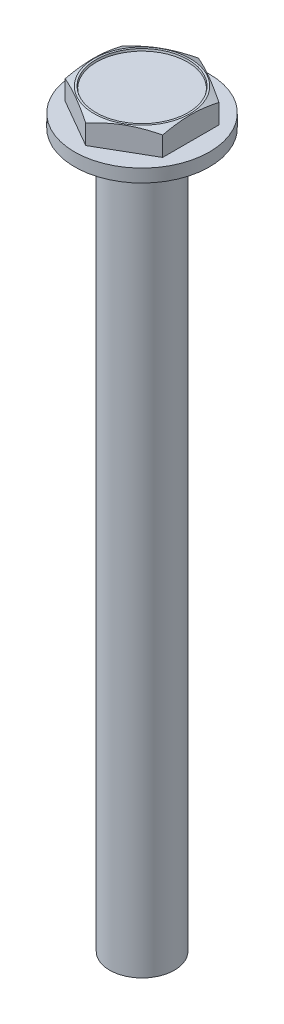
ISO-10303-21;
HEADER;
FILE_DESCRIPTION(('STEP AP214'),'2;1');
FILE_NAME('part.step','',(''),(''),'','','');
FILE_SCHEMA(('AUTOMOTIVE_DESIGN { 1 0 10303 214 1 1 1 1 }'));
ENDSEC;
DATA;
#1=APPLICATION_CONTEXT('core data for automotive mechanical design processes');
#2=APPLICATION_PROTOCOL_DEFINITION('international standard','automotive_design',2000,#1);
#3=PRODUCT_CONTEXT('',#1,'mechanical');
#4=PRODUCT('Part','Part','',(#3));
#5=PRODUCT_RELATED_PRODUCT_CATEGORY('part','',(#4));
#6=PRODUCT_DEFINITION_FORMATION('','',#4);
#7=PRODUCT_DEFINITION_CONTEXT('part definition',#1,'design');
#8=PRODUCT_DEFINITION('design','',#6,#7);
#9=PRODUCT_DEFINITION_SHAPE('','',#8);
#10=(LENGTH_UNIT() NAMED_UNIT(*) SI_UNIT(.MILLI.,.METRE.));
#11=(NAMED_UNIT(*) PLANE_ANGLE_UNIT() SI_UNIT($,.RADIAN.));
#12=(NAMED_UNIT(*) SI_UNIT($,.STERADIAN.) SOLID_ANGLE_UNIT());
#13=UNCERTAINTY_MEASURE_WITH_UNIT(LENGTH_MEASURE(1.E-05),#10,'distance_accuracy_value','');
#14=(GEOMETRIC_REPRESENTATION_CONTEXT(3) GLOBAL_UNCERTAINTY_ASSIGNED_CONTEXT((#13)) GLOBAL_UNIT_ASSIGNED_CONTEXT((#10,
#11,#12)) REPRESENTATION_CONTEXT('',''));
#15=CARTESIAN_POINT('',(0.,0.,0.));
#16=DIRECTION('',(0.,0.,1.));
#17=DIRECTION('',(1.,0.,0.));
#18=AXIS2_PLACEMENT_3D('',#15,#16,#17);
#19=CARTESIAN_POINT('',(0.,0.,0.));
#20=DIRECTION('',(0.,-1.,0.));
#21=DIRECTION('',(0.,0.,-1.));
#22=AXIS2_PLACEMENT_3D('',#19,#20,#21);
#23=CYLINDRICAL_SURFACE('',#22,3.30199714);
#24=CARTESIAN_POINT('',(0.,0.,0.));
#25=DIRECTION('',(0.,-1.,0.));
#26=DIRECTION('',(0.,0.,-1.));
#27=AXIS2_PLACEMENT_3D('',#24,#25,#26);
#28=CIRCLE('',#27,3.30199714);
#29=CARTESIAN_POINT('',(0.,0.,-3.30199714));
#30=VERTEX_POINT('',#29);
#31=EDGE_CURVE('E133',#30,#30,#28,.T.);
#32=ORIENTED_EDGE('',*,*,#31,.F.);
#33=EDGE_LOOP('',(#32));
#34=FACE_BOUND('',#33,.T.);
#35=CARTESIAN_POINT('',(0.,0.63499945,0.));
#36=DIRECTION('',(0.,1.,0.));
#37=DIRECTION('',(0.,0.,1.));
#38=AXIS2_PLACEMENT_3D('',#35,#36,#37);
#39=CIRCLE('',#38,3.30199714);
#40=CARTESIAN_POINT('',(0.,0.63499945,3.30199714));
#41=VERTEX_POINT('',#40);
#42=EDGE_CURVE('E32',#41,#41,#39,.F.);
#43=ORIENTED_EDGE('',*,*,#42,.T.);
#44=EDGE_LOOP('',(#43));
#45=FACE_BOUND('',#44,.T.);
#46=ADVANCED_FACE('F28',(#34,#45),#23,.T.);
#47=CARTESIAN_POINT('',(0.,0.,0.));
#48=DIRECTION('',(0.,-1.,0.));
#49=DIRECTION('',(0.,0.,-1.));
#50=AXIS2_PLACEMENT_3D('',#47,#48,#49);
#51=PLANE('',#50);
#52=CARTESIAN_POINT('',(0.,0.,0.));
#53=DIRECTION('',(0.,-1.,0.));
#54=DIRECTION('',(0.,0.,-1.));
#55=AXIS2_PLACEMENT_3D('',#52,#53,#54);
#56=CIRCLE('',#55,1.587498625);
#57=CARTESIAN_POINT('',(0.,0.,-1.587498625));
#58=VERTEX_POINT('',#57);
#59=EDGE_CURVE('E136',#58,#58,#56,.T.);
#60=ORIENTED_EDGE('',*,*,#59,.F.);
#61=EDGE_LOOP('',(#60));
#62=FACE_BOUND('',#61,.T.);
#63=ORIENTED_EDGE('',*,*,#31,.T.);
#64=EDGE_LOOP('',(#63));
#65=FACE_BOUND('',#64,.T.);
#66=ADVANCED_FACE('F30',(#62,#65),#51,.T.);
#67=CARTESIAN_POINT('',(0.,-34.925,0.));
#68=DIRECTION('',(0.,-1.,0.));
#69=DIRECTION('',(0.,0.,-1.));
#70=AXIS2_PLACEMENT_3D('',#67,#68,#69);
#71=PLANE('',#70);
#72=CARTESIAN_POINT('',(0.,-34.925,0.));
#73=DIRECTION('',(0.,-1.,0.));
#74=DIRECTION('',(0.,0.,-1.));
#75=AXIS2_PLACEMENT_3D('',#72,#73,#74);
#76=CIRCLE('',#75,1.587498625);
#77=CARTESIAN_POINT('',(0.,-34.925,-1.587498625));
#78=VERTEX_POINT('',#77);
#79=EDGE_CURVE('E121',#78,#78,#76,.T.);
#80=ORIENTED_EDGE('',*,*,#79,.T.);
#81=EDGE_LOOP('',(#80));
#82=FACE_BOUND('',#81,.T.);
#83=ADVANCED_FACE('F212',(#82),#71,.T.);
#84=CARTESIAN_POINT('',(0.,0.,0.));
#85=DIRECTION('',(0.,-1.,0.));
#86=DIRECTION('',(0.,0.,-1.));
#87=AXIS2_PLACEMENT_3D('',#84,#85,#86);
#88=CYLINDRICAL_SURFACE('',#87,1.587498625);
#89=ORIENTED_EDGE('',*,*,#59,.T.);
#90=EDGE_LOOP('',(#89));
#91=FACE_BOUND('',#90,.T.);
#92=ORIENTED_EDGE('',*,*,#79,.F.);
#93=EDGE_LOOP('',(#92));
#94=FACE_BOUND('',#93,.T.);
#95=ADVANCED_FACE('F219',(#91,#94),#88,.T.);
#96=CARTESIAN_POINT('',(-3.632196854,0.63499945,3.632196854));
#97=DIRECTION('',(0.,1.,0.));
#98=DIRECTION('',(0.,0.,1.));
#99=AXIS2_PLACEMENT_3D('',#96,#97,#98);
#100=PLANE('',#99);
#101=ORIENTED_EDGE('',*,*,#42,.F.);
#102=EDGE_LOOP('',(#101));
#103=FACE_BOUND('',#102,.T.);
#104=DIRECTION('',(-0.866025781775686,0.,0.499999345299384));
#105=VECTOR('',#104,1.);
#106=CARTESIAN_POINT('',(1.87579371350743E-06,0.63499945,-2.75696049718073));
#107=LINE('',#106,#105);
#108=CARTESIAN_POINT('',(1.87579371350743E-06,0.63499945,-2.75696049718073));
#109=VERTEX_POINT('',#108);
#110=CARTESIAN_POINT('',(-2.38759668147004,0.63499945,-1.37848223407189));
#111=VERTEX_POINT('',#110);
#112=EDGE_CURVE('E86',#109,#111,#107,.T.);
#113=ORIENTED_EDGE('',*,*,#112,.F.);
#114=DIRECTION('',(-0.866025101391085,0.,-0.500000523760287));
#115=VECTOR('',#114,1.);
#116=CARTESIAN_POINT('',(2.38759855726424,0.63499945,-1.37847898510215));
#117=LINE('',#116,#115);
#118=CARTESIAN_POINT('',(2.38759855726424,0.63499945,-1.37847898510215));
#119=VERTEX_POINT('',#118);
#120=EDGE_CURVE('E106',#119,#109,#117,.T.);
#121=ORIENTED_EDGE('',*,*,#120,.F.);
#122=DIRECTION('',(4.53589793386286E-07,0.,-0.999999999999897));
#123=VECTOR('',#122,1.);
#124=CARTESIAN_POINT('',(2.38759730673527,0.63499945,1.37848115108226));
#125=LINE('',#124,#123);
#126=CARTESIAN_POINT('',(2.38759730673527,0.63499945,1.37848115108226));
#127=VERTEX_POINT('',#126);
#128=EDGE_CURVE('E103',#127,#119,#125,.T.);
#129=ORIENTED_EDGE('',*,*,#128,.F.);
#130=DIRECTION('',(0.866025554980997,0.,-0.499999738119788));
#131=VECTOR('',#130,1.);
#132=CARTESIAN_POINT('',(-6.25264571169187E-07,0.63499945,2.7569604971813));
#133=LINE('',#132,#131);
#134=CARTESIAN_POINT('',(-6.25264571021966E-07,0.63499945,2.7569604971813));
#135=VERTEX_POINT('',#134);
#136=EDGE_CURVE('E96',#135,#127,#133,.T.);
#137=ORIENTED_EDGE('',*,*,#136,.F.);
#138=DIRECTION('',(0.86602532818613,0.,0.500000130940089));
#139=VECTOR('',#138,1.);
#140=CARTESIAN_POINT('',(-2.387597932,0.63499945,1.37848006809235));
#141=LINE('',#140,#139);
#142=CARTESIAN_POINT('',(-2.387597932,0.63499945,1.37848006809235));
#143=VERTEX_POINT('',#142);
#144=EDGE_CURVE('E82',#143,#135,#141,.T.);
#145=ORIENTED_EDGE('',*,*,#144,.F.);
#146=DIRECTION('',(-4.53589793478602E-07,0.,0.999999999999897));
#147=VECTOR('',#146,1.);
#148=CARTESIAN_POINT('',(-2.38759668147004,0.63499945,-1.37848223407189));
#149=LINE('',#148,#147);
#150=EDGE_CURVE('E92',#111,#143,#149,.T.);
#151=ORIENTED_EDGE('',*,*,#150,.F.);
#152=EDGE_LOOP('',(#113,#121,#129,#137,#145,#151));
#153=FACE_BOUND('',#152,.T.);
#154=ADVANCED_FACE('F91',(#103,#153),#100,.T.);
#155=CARTESIAN_POINT('',(-2.38759668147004,0.63499945,-1.37848223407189));
#156=DIRECTION('',(-0.999999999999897,0.,-4.53589793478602E-07));
#157=DIRECTION('',(-4.53589793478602E-07,0.,0.999999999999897));
#158=AXIS2_PLACEMENT_3D('',#155,#156,#157);
#159=PLANE('',#158);
#160=DIRECTION('',(0.,1.,0.));
#161=VECTOR('',#160,1.);
#162=CARTESIAN_POINT('',(-2.38759668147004,0.63499945,-1.37848223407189));
#163=LINE('',#162,#161);
#164=CARTESIAN_POINT('',(-2.38759668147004,1.58662449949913,-1.37848223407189));
#165=VERTEX_POINT('',#164);
#166=EDGE_CURVE('E99',#111,#165,#163,.T.);
#167=ORIENTED_EDGE('',*,*,#166,.F.);
#168=ORIENTED_EDGE('',*,*,#150,.T.);
#169=DIRECTION('',(0.,1.,0.));
#170=VECTOR('',#169,1.);
#171=CARTESIAN_POINT('',(-2.387597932,0.63499945,1.37848006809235));
#172=LINE('',#171,#170);
#173=CARTESIAN_POINT('',(-2.387597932,1.58662449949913,1.37848006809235));
#174=VERTEX_POINT('',#173);
#175=EDGE_CURVE('E79',#143,#174,#172,.T.);
#176=ORIENTED_EDGE('',*,*,#175,.T.);
#177=CARTESIAN_POINT('',(-2.38759563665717,0.82592264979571,-3.68191339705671));
#178=CARTESIAN_POINT('',(-2.38759568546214,0.868007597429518,-3.5743162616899));
#179=CARTESIAN_POINT('',(-2.38759573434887,0.909640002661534,-3.46653884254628));
#180=CARTESIAN_POINT('',(-2.3875958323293,0.991743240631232,-3.25052774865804));
#181=CARTESIAN_POINT('',(-2.38759588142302,1.03221392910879,-3.14229401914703));
#182=CARTESIAN_POINT('',(-2.38759598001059,1.11185744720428,-2.92494439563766));
#183=CARTESIAN_POINT('',(-2.38759602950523,1.15102557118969,-2.81582677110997));
#184=CARTESIAN_POINT('',(-2.38759612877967,1.22755881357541,-2.59696285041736));
#185=CARTESIAN_POINT('',(-2.38759617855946,1.26492399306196,-2.48721657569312));
#186=CARTESIAN_POINT('',(-2.3875962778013,1.33690696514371,-2.26842452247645));
#187=CARTESIAN_POINT('',(-2.38759632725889,1.37155447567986,-2.15938857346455));
#188=CARTESIAN_POINT('',(-2.38759642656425,1.43805781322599,-1.94045649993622));
#189=CARTESIAN_POINT('',(-2.38759647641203,1.4699134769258,-1.83056032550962));
#190=CARTESIAN_POINT('',(-2.38759657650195,1.53006082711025,-1.60989856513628));
#191=CARTESIAN_POINT('',(-2.38759662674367,1.55835590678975,-1.49913391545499));
#192=CARTESIAN_POINT('',(-2.38759672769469,1.6105119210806,-1.27657374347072));
#193=CARTESIAN_POINT('',(-2.38759677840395,1.63437327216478,-1.16477831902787));
#194=CARTESIAN_POINT('',(-2.38759689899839,1.68436690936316,-0.898911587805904));
#195=CARTESIAN_POINT('',(-2.38759696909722,1.70812390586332,-0.744369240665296));
#196=CARTESIAN_POINT('',(-2.38759707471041,1.73414034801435,-0.511530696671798));
#197=CARTESIAN_POINT('',(-2.38759710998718,1.74120899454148,-0.433758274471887));
#198=CARTESIAN_POINT('',(-2.38759718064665,1.7519158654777,-0.277979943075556));
#199=CARTESIAN_POINT('',(-2.38759721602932,1.75555444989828,-0.199974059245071));
#200=CARTESIAN_POINT('',(-2.3875972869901,1.75927506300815,-0.043531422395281));
#201=CARTESIAN_POINT('',(-2.38759732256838,1.75934126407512,0.0349057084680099));
#202=CARTESIAN_POINT('',(-2.3875973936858,1.75587572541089,0.191693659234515));
#203=CARTESIAN_POINT('',(-2.38759742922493,1.75234425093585,0.270044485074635));
#204=CARTESIAN_POINT('',(-2.38759750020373,1.74181206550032,0.426526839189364));
#205=CARTESIAN_POINT('',(-2.38759753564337,1.73481064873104,0.504658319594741));
#206=CARTESIAN_POINT('',(-2.38759760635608,1.71757822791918,0.660554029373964));
#207=CARTESIAN_POINT('',(-2.38759764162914,1.70734734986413,0.738318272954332));
#208=CARTESIAN_POINT('',(-2.38759777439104,1.6632145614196,1.03100981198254));
#209=CARTESIAN_POINT('',(-2.38759787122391,1.61952154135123,1.24449097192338));
#210=CARTESIAN_POINT('',(-2.38759801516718,1.54248199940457,1.56183336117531));
#211=CARTESIAN_POINT('',(-2.38759806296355,1.51486214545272,1.66720691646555));
#212=CARTESIAN_POINT('',(-2.38759815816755,1.45652585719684,1.87709700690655));
#213=CARTESIAN_POINT('',(-2.38759820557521,1.42580963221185,1.98161359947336));
#214=CARTESIAN_POINT('',(-2.38759834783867,1.32960807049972,2.29525260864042));
#215=CARTESIAN_POINT('',(-2.38759844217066,1.26038803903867,2.50322024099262));
#216=CARTESIAN_POINT('',(-2.38759862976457,1.11566696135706,2.91679636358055));
#217=CARTESIAN_POINT('',(-2.387598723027,1.04016911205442,3.12240599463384));
#218=CARTESIAN_POINT('',(-2.38759890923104,0.884641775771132,3.53291795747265));
#219=CARTESIAN_POINT('',(-2.38759900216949,0.804594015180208,3.73781332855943));
#220=CARTESIAN_POINT('',(-2.38759918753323,0.641592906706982,4.14647276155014));
#221=CARTESIAN_POINT('',(-2.38759927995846,0.558639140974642,4.35023665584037));
#222=CARTESIAN_POINT('',(-2.3875994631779,0.391826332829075,4.75416868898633));
#223=CARTESIAN_POINT('',(-2.38759955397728,0.307994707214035,4.95434818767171));
#224=CARTESIAN_POINT('',(-2.38759973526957,0.138862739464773,5.35403153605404));
#225=CARTESIAN_POINT('',(-2.38759982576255,0.053562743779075,5.55353553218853));
#226=CARTESIAN_POINT('',(-2.38759991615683,-0.0322324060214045,5.75282195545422));
#227=B_SPLINE_CURVE_WITH_KNOTS('',3,(#177,#178,#179,#180,#181,#182,#183,#184,#185,#186,#187,
#188,#189,#190,#191,#192,#193,#194,#195,#196,#197,#198,#199,#200,#201,#202,#203,#204,#205,#206,
#207,#208,#209,#210,#211,#212,#213,#214,#215,#216,#217,#218,#219,#220,#221,#222,#223,#224,#225,
#226),.UNSPECIFIED.,.F.,.F.,(4,2,2,2,2,2,2,2,2,2,2,2,2,2,2,2,2,2,2,2,2,2,2,2,4),(0.,
0.346607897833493,0.693258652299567,1.04104935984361,1.38882827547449,1.73202382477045,
2.07523943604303,2.4181254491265,2.76097923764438,3.22954472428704,3.46376008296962,
3.69795085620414,3.93317913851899,4.16839007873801,4.40364888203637,4.63889850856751,
5.29155455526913,5.61833976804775,5.94510290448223,6.60247648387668,7.25951732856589,
7.91941453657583,8.57940702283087,9.23047341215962,9.88138823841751),.UNSPECIFIED.);
#228=EDGE_CURVE('E11',#165,#174,#227,.T.);
#229=ORIENTED_EDGE('',*,*,#228,.F.);
#230=EDGE_LOOP('',(#167,#168,#176,#229));
#231=FACE_BOUND('',#230,.T.);
#232=ADVANCED_FACE('F98',(#231),#159,.T.);
#233=CARTESIAN_POINT('',(1.87579371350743E-06,0.63499945,-2.75696049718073));
#234=DIRECTION('',(-0.499999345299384,0.,-0.866025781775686));
#235=DIRECTION('',(-0.866025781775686,0.,0.499999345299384));
#236=AXIS2_PLACEMENT_3D('',#233,#234,#235);
#237=PLANE('',#236);
#238=DIRECTION('',(0.,1.,0.));
#239=VECTOR('',#238,1.);
#240=CARTESIAN_POINT('',(1.87579371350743E-06,0.63499945,-2.75696049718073));
#241=LINE('',#240,#239);
#242=CARTESIAN_POINT('',(1.87579371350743E-06,1.58662449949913,-2.75696049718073));
#243=VERTEX_POINT('',#242);
#244=EDGE_CURVE('E111',#109,#243,#241,.T.);
#245=ORIENTED_EDGE('',*,*,#244,.F.);
#246=ORIENTED_EDGE('',*,*,#112,.T.);
#247=ORIENTED_EDGE('',*,*,#166,.T.);
#248=CARTESIAN_POINT('',(0.00020187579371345,1.58657065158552,-2.75707596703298));
#249=CARTESIAN_POINT('',(-0.072006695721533,1.60601236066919,-2.71538640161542));
#250=CARTESIAN_POINT('',(-0.144481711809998,1.62420572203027,-2.67354300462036));
#251=CARTESIAN_POINT('',(-0.289975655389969,1.65766237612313,-2.58954218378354));
#252=CARTESIAN_POINT('',(-0.362994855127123,1.67292408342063,-2.54738460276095));
#253=CARTESIAN_POINT('',(-0.509578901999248,1.70007484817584,-2.46275441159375));
#254=CARTESIAN_POINT('',(-0.583144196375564,1.71196073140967,-2.42028154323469));
#255=CARTESIAN_POINT('',(-0.730652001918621,1.73192108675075,-2.33511802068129));
#256=CARTESIAN_POINT('',(-0.804594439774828,1.73999627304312,-2.29242740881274));
#257=CARTESIAN_POINT('',(-0.951197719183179,1.75188911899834,-2.20778611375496));
#258=CARTESIAN_POINT('',(-1.02385333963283,1.75579159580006,-2.1658384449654));
#259=CARTESIAN_POINT('',(-1.16924844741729,1.7594692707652,-2.0818946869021));
#260=CARTESIAN_POINT('',(-1.24198793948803,1.75924422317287,-2.03989859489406));
#261=CARTESIAN_POINT('',(-1.38729615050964,1.75467833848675,-1.95600500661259));
#262=CARTESIAN_POINT('',(-1.45986496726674,1.75034158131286,-1.91410745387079));
#263=CARTESIAN_POINT('',(-1.60474605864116,1.73773860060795,-1.83046046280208));
#264=CARTESIAN_POINT('',(-1.67705832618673,1.72947226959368,-1.78871102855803));
#265=CARTESIAN_POINT('',(-1.80267576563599,1.7119279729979,-1.71618589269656));
#266=CARTESIAN_POINT('',(-1.85606796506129,1.70346223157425,-1.68535994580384));
#267=CARTESIAN_POINT('',(-1.96260822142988,1.68470190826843,-1.62384900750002));
#268=CARTESIAN_POINT('',(-2.01575628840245,1.67440740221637,-1.59316401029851));
#269=CARTESIAN_POINT('',(-2.12221905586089,1.65206814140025,-1.53169781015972));
#270=CARTESIAN_POINT('',(-2.17553161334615,1.6400098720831,-1.50091784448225));
#271=CARTESIAN_POINT('',(-2.28187473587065,1.61438127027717,-1.43952072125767));
#272=CARTESIAN_POINT('',(-2.3349053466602,1.60081119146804,-1.40890353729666));
#273=CARTESIAN_POINT('',(-2.38779668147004,1.58657065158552,-1.37836676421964));
#274=B_SPLINE_CURVE_WITH_KNOTS('',3,(#248,#249,#250,#251,#252,#253,#254,#255,#256,#257,#258,
#259,#260,#261,#262,#263,#264,#265,#266,#267,#268,#269,#270,#271,#272,#273),.UNSPECIFIED.,.F.,
.F.,(4,2,2,2,2,2,2,2,2,2,2,2,4),(0.,0.256862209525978,0.51386294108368,0.771104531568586,
1.02829789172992,1.28015774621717,1.53203259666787,1.78365778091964,2.03528984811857,
2.22195401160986,2.40861043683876,2.59678030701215,2.78491864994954),.UNSPECIFIED.);
#275=EDGE_CURVE('E37',#243,#165,#274,.T.);
#276=ORIENTED_EDGE('',*,*,#275,.F.);
#277=EDGE_LOOP('',(#245,#246,#247,#276));
#278=FACE_BOUND('',#277,.T.);
#279=ADVANCED_FACE('F164',(#278),#237,.T.);
#280=CARTESIAN_POINT('',(2.38759855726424,0.63499945,-1.37847898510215));
#281=DIRECTION('',(0.500000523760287,0.,-0.866025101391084));
#282=DIRECTION('',(-0.866025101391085,0.,-0.500000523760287));
#283=AXIS2_PLACEMENT_3D('',#280,#281,#282);
#284=PLANE('',#283);
#285=DIRECTION('',(0.,1.,0.));
#286=VECTOR('',#285,1.);
#287=CARTESIAN_POINT('',(2.38759855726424,0.63499945,-1.37847898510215));
#288=LINE('',#287,#286);
#289=CARTESIAN_POINT('',(2.38759855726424,1.58662449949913,-1.37847898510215));
#290=VERTEX_POINT('',#289);
#291=EDGE_CURVE('E114',#119,#290,#288,.T.);
#292=ORIENTED_EDGE('',*,*,#291,.F.);
#293=ORIENTED_EDGE('',*,*,#120,.T.);
#294=ORIENTED_EDGE('',*,*,#244,.T.);
#295=CARTESIAN_POINT('',(2.38779855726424,1.58657065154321,-1.37836351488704));
#296=CARTESIAN_POINT('',(2.31559004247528,1.60601236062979,-1.42005317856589));
#297=CARTESIAN_POINT('',(2.24311508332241,1.62420572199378,-1.46189667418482));
#298=CARTESIAN_POINT('',(2.09762125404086,1.65766237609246,-1.54589769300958));
#299=CARTESIAN_POINT('',(2.02460211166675,1.67292408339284,-1.58805537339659));
#300=CARTESIAN_POINT('',(1.87801817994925,1.70007484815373,-1.67268576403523));
#301=CARTESIAN_POINT('',(1.80445294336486,1.71196073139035,-1.71515873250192));
#302=CARTESIAN_POINT('',(1.65694525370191,1.73192108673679,-1.80032245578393));
#303=CARTESIAN_POINT('',(1.58300287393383,1.73999627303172,-1.84301316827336));
#304=CARTESIAN_POINT('',(1.43639970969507,1.75188911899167,-1.92765466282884));
#305=CARTESIAN_POINT('',(1.36374414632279,1.75579159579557,-1.9696024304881));
#306=CARTESIAN_POINT('',(1.21834915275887,1.75946927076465,-2.05354638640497));
#307=CARTESIAN_POINT('',(1.1456097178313,1.7592442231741,-2.09554257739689));
#308=CARTESIAN_POINT('',(1.00030162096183,1.75467833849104,-2.17943636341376));
#309=CARTESIAN_POINT('',(0.927732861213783,1.75034158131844,-2.22133401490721));
#310=CARTESIAN_POINT('',(0.782851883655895,1.73773860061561,-2.30498120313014));
#311=CARTESIAN_POINT('',(0.710539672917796,1.72947226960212,-2.34673073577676));
#312=CARTESIAN_POINT('',(0.584922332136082,1.71192797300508,-2.41925604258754));
#313=CARTESIAN_POINT('',(0.531530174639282,1.70346223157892,-2.45008206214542));
#314=CARTESIAN_POINT('',(0.42499000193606,1.6847019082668,-2.51159314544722));
#315=CARTESIAN_POINT('',(0.371841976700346,1.67440740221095,-2.54227821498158));
#316=CARTESIAN_POINT('',(0.265379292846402,1.65206814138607,-2.60374456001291));
#317=CARTESIAN_POINT('',(0.212066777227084,1.64000987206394,-2.63452459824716));
#318=CARTESIAN_POINT('',(0.105723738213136,1.6143812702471,-2.69592186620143));
#319=CARTESIAN_POINT('',(0.0526931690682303,1.60081119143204,-2.72653912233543));
#320=CARTESIAN_POINT('',(-0.000198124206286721,1.58657065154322,-2.75707596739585));
#321=B_SPLINE_CURVE_WITH_KNOTS('',3,(#295,#296,#297,#298,#299,#300,#301,#302,#303,#304,#305,
#306,#307,#308,#309,#310,#311,#312,#313,#314,#315,#316,#317,#318,#319,#320),.UNSPECIFIED.,.F.,
.F.,(4,2,2,2,2,2,2,2,2,2,2,2,4),(0.,0.256862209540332,0.513862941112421,0.771104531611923,
1.02829789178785,1.28015774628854,1.53203259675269,1.78365778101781,2.0352898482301,
2.22195401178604,2.40861043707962,2.5967803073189,2.7849186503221),.UNSPECIFIED.);
#322=EDGE_CURVE('E176',#290,#243,#321,.T.);
#323=ORIENTED_EDGE('',*,*,#322,.F.);
#324=EDGE_LOOP('',(#292,#293,#294,#323));
#325=FACE_BOUND('',#324,.T.);
#326=ADVANCED_FACE('F183',(#325),#284,.T.);
#327=CARTESIAN_POINT('',(2.38759730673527,0.63499945,1.37848115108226));
#328=DIRECTION('',(0.999999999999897,0.,4.53589793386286E-07));
#329=DIRECTION('',(4.53589793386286E-07,0.,-0.999999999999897));
#330=AXIS2_PLACEMENT_3D('',#327,#328,#329);
#331=PLANE('',#330);
#332=DIRECTION('',(0.,1.,0.));
#333=VECTOR('',#332,1.);
#334=CARTESIAN_POINT('',(2.38759730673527,0.63499945,1.37848115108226));
#335=LINE('',#334,#333);
#336=CARTESIAN_POINT('',(2.38759730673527,1.58662449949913,1.37848115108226));
#337=VERTEX_POINT('',#336);
#338=EDGE_CURVE('E117',#127,#337,#335,.T.);
#339=ORIENTED_EDGE('',*,*,#338,.F.);
#340=ORIENTED_EDGE('',*,*,#128,.T.);
#341=ORIENTED_EDGE('',*,*,#291,.T.);
#342=CARTESIAN_POINT('',(2.38759960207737,0.825922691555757,-3.68191071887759));
#343=CARTESIAN_POINT('',(2.3875995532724,0.868007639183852,-3.57431357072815));
#344=CARTESIAN_POINT('',(2.38759950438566,0.90964004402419,-3.46653613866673));
#345=CARTESIAN_POINT('',(2.38759940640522,0.991743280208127,-3.25052501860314));
#346=CARTESIAN_POINT('',(2.3875993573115,1.03221396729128,-3.14229127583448));
#347=CARTESIAN_POINT('',(2.38759925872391,1.1118574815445,-2.9249416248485));
#348=CARTESIAN_POINT('',(2.38759920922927,1.1510256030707,-2.81582398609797));
#349=CARTESIAN_POINT('',(2.38759910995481,1.22755883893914,-2.59696003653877));
#350=CARTESIAN_POINT('',(2.38759906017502,1.26492401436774,-2.48721374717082));
#351=CARTESIAN_POINT('',(2.38759896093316,1.33690697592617,-2.26842166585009));
#352=CARTESIAN_POINT('',(2.38759891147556,1.37155448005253,-2.15938570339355));
#353=CARTESIAN_POINT('',(2.38759881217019,1.43805780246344,-1.94045360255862));
#354=CARTESIAN_POINT('',(2.38759876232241,1.46991345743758,-1.83055741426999));
#355=CARTESIAN_POINT('',(2.38759866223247,1.53006078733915,-1.609895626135));
#356=CARTESIAN_POINT('',(2.38759861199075,1.55835585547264,-1.49913096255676));
#357=CARTESIAN_POINT('',(2.38759851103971,1.61051184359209,-1.27657076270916));
#358=CARTESIAN_POINT('',(2.38759846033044,1.63437318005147,-1.16477532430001));
#359=CARTESIAN_POINT('',(2.387598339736,1.68436677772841,-0.89890856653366));
#360=CARTESIAN_POINT('',(2.38759826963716,1.70812374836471,-0.744366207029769));
#361=CARTESIAN_POINT('',(2.38759816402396,1.73414014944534,-0.511527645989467));
#362=CARTESIAN_POINT('',(2.38759812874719,1.7412087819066,-0.433755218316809));
#363=CARTESIAN_POINT('',(2.38759805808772,1.75191562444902,-0.277976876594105));
#364=CARTESIAN_POINT('',(2.38759802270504,1.75555419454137,-0.199970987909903));
#365=CARTESIAN_POINT('',(2.38759795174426,1.75927477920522,-0.0435283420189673));
#366=CARTESIAN_POINT('',(2.38759791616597,1.75934096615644,0.0349087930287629));
#367=CARTESIAN_POINT('',(2.38759784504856,1.7558754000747,0.191696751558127));
#368=CARTESIAN_POINT('',(2.38759780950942,1.75234391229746,0.270047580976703));
#369=CARTESIAN_POINT('',(2.38759773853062,1.74181170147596,0.426529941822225));
#370=CARTESIAN_POINT('',(2.38759770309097,1.73481027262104,0.5046614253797));
#371=CARTESIAN_POINT('',(2.38759763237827,1.71757782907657,0.660557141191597));
#372=CARTESIAN_POINT('',(2.3875975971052,1.70734694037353,0.738321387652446));
#373=CARTESIAN_POINT('',(2.38759746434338,1.66321414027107,1.03101276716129));
#374=CARTESIAN_POINT('',(2.38759736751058,1.61952114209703,1.24449376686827));
#375=CARTESIAN_POINT('',(2.38759722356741,1.5424816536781,1.56183592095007));
#376=CARTESIAN_POINT('',(2.38759717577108,1.51486182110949,1.66720939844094));
#377=CARTESIAN_POINT('',(2.38759708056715,1.45652558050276,1.87709933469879));
#378=CARTESIAN_POINT('',(2.38759703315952,1.42580938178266,1.98161585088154));
#379=CARTESIAN_POINT('',(2.38759689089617,1.32960790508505,2.29525462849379));
#380=CARTESIAN_POINT('',(2.38759679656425,1.26038793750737,2.50322210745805));
#381=CARTESIAN_POINT('',(2.38759660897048,1.1156669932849,2.91679792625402));
#382=CARTESIAN_POINT('',(2.38759651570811,1.04016921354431,3.12240740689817));
#383=CARTESIAN_POINT('',(2.38759632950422,0.884642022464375,3.53291906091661));
#384=CARTESIAN_POINT('',(2.38759623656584,0.804594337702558,3.73781427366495));
#385=CARTESIAN_POINT('',(2.38759605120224,0.641593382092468,4.14647339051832));
#386=CARTESIAN_POINT('',(2.38759595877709,0.558639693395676,4.35023712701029));
#387=CARTESIAN_POINT('',(2.38759577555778,0.391827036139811,4.75416885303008));
#388=CARTESIAN_POINT('',(2.38759568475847,0.307995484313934,4.954348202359));
#389=CARTESIAN_POINT('',(2.38759550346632,0.138863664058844,5.35403125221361));
#390=CARTESIAN_POINT('',(2.38759541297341,0.0535637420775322,5.55353509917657));
#391=CARTESIAN_POINT('',(2.38759532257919,-0.0322313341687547,5.75282137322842));
#392=B_SPLINE_CURVE_WITH_KNOTS('',3,(#342,#343,#344,#345,#346,#347,#348,#349,#350,#351,#352,
#353,#354,#355,#356,#357,#358,#359,#360,#361,#362,#363,#364,#365,#366,#367,#368,#369,#370,#371,
#372,#373,#374,#375,#376,#377,#378,#379,#380,#381,#382,#383,#384,#385,#386,#387,#388,#389,#390,
#391),.UNSPECIFIED.,.F.,.F.,(4,2,2,2,2,2,2,2,2,2,2,2,2,2,2,2,2,2,2,2,2,2,2,2,4),(0.,
0.346607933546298,0.693258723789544,1.04104946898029,1.38882842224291,1.73202400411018,
2.07523964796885,2.41812569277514,2.76097951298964,3.22954502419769,3.4637603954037,
3.69795118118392,3.93317947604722,4.16839042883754,4.40364924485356,4.638898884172,
5.29155445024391,5.61833942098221,5.94510231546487,6.60247539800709,7.25951574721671,
7.91941243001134,8.57940439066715,9.23047028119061,9.88138460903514),.UNSPECIFIED.);
#393=EDGE_CURVE('E192',#337,#290,#392,.F.);
#394=ORIENTED_EDGE('',*,*,#393,.F.);
#395=EDGE_LOOP('',(#339,#340,#341,#394));
#396=FACE_BOUND('',#395,.T.);
#397=ADVANCED_FACE('F187',(#396),#331,.T.);
#398=CARTESIAN_POINT('',(-6.25264571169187E-07,0.63499945,2.7569604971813));
#399=DIRECTION('',(0.499999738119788,0.,0.866025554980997));
#400=DIRECTION('',(0.866025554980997,0.,-0.499999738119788));
#401=AXIS2_PLACEMENT_3D('',#398,#399,#400);
#402=PLANE('',#401);
#403=DIRECTION('',(0.,1.,0.));
#404=VECTOR('',#403,1.);
#405=CARTESIAN_POINT('',(-6.25264571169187E-07,0.63499945,2.7569604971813));
#406=LINE('',#405,#404);
#407=CARTESIAN_POINT('',(-6.2526457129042E-07,1.58662449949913,2.7569604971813));
#408=VERTEX_POINT('',#407);
#409=EDGE_CURVE('E44',#135,#408,#406,.T.);
#410=ORIENTED_EDGE('',*,*,#409,.F.);
#411=ORIENTED_EDGE('',*,*,#136,.T.);
#412=ORIENTED_EDGE('',*,*,#338,.T.);
#413=CARTESIAN_POINT('',(-0.000200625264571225,1.58657065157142,2.7570759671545));
#414=CARTESIAN_POINT('',(0.0720079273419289,1.60601236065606,2.71538636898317));
#415=CARTESIAN_POINT('',(0.144482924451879,1.62420572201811,2.67354293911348));
#416=CARTESIAN_POINT('',(0.289976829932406,1.65766237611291,2.58954205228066));
#417=CARTESIAN_POINT('',(0.36299601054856,1.67292408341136,2.54738443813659));
#418=CARTESIAN_POINT('',(0.509580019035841,1.70007484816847,2.46275418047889));
#419=CARTESIAN_POINT('',(0.583145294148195,1.71196073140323,2.42028127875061));
#420=CARTESIAN_POINT('',(0.730653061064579,1.7319210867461,2.33511768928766));
#421=CARTESIAN_POINT('',(0.804595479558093,1.73999627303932,2.29242704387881));
#422=CARTESIAN_POINT('',(0.95119872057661,1.75188911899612,2.20778568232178));
#423=CARTESIAN_POINT('',(1.02385432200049,1.75579159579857,2.16583798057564));
#424=CARTESIAN_POINT('',(1.16924939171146,1.75946927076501,2.08189415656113));
#425=CARTESIAN_POINT('',(1.2419888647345,1.75924422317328,2.03989803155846));
#426=CARTESIAN_POINT('',(1.38729703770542,1.75467833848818,1.95600437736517));
#427=CARTESIAN_POINT('',(1.45986583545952,1.75034158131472,1.91410679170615));
#428=CARTESIAN_POINT('',(1.60474688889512,1.7377386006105,1.83045973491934));
#429=CARTESIAN_POINT('',(1.67705913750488,1.72947226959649,1.78871026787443));
#430=CARTESIAN_POINT('',(1.80267654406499,1.71192797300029,1.71618507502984));
#431=CARTESIAN_POINT('',(1.85606872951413,1.7034622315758,1.6853591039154));
#432=CARTESIAN_POINT('',(1.96260895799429,1.68470190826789,1.6238481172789));
#433=CARTESIAN_POINT('',(2.01575701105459,1.67440740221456,1.59316309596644));
#434=CARTESIAN_POINT('',(2.12221975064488,1.65206814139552,1.53169684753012));
#435=CARTESIAN_POINT('',(2.17553229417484,1.64000987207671,1.50091685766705));
#436=CARTESIAN_POINT('',(2.28187538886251,1.61438127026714,1.43951968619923));
#437=CARTESIAN_POINT('',(2.33490598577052,1.60081119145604,1.40890247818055));
#438=CARTESIAN_POINT('',(2.38779730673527,1.58657065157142,1.37836568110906));
#439=B_SPLINE_CURVE_WITH_KNOTS('',3,(#413,#414,#415,#416,#417,#418,#419,#420,#421,#422,#423,
#424,#425,#426,#427,#428,#429,#430,#431,#432,#433,#434,#435,#436,#437,#438),.UNSPECIFIED.,.F.,
.F.,(4,2,2,2,2,2,2,2,2,2,2,2,4),(0.,0.256862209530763,0.51386294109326,0.771104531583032,
1.02829789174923,1.28015774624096,1.53203259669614,1.78365778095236,2.03528984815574,
2.22195401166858,2.40861043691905,2.5967803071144,2.78491865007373),.UNSPECIFIED.);
#440=EDGE_CURVE('E145',#408,#337,#439,.T.);
#441=ORIENTED_EDGE('',*,*,#440,.F.);
#442=EDGE_LOOP('',(#410,#411,#412,#441));
#443=FACE_BOUND('',#442,.T.);
#444=ADVANCED_FACE('F158',(#443),#402,.T.);
#445=CARTESIAN_POINT('',(-2.387597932,0.63499945,1.37848006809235));
#446=DIRECTION('',(-0.500000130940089,0.,0.86602532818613));
#447=DIRECTION('',(0.86602532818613,0.,0.500000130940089));
#448=AXIS2_PLACEMENT_3D('',#445,#446,#447);
#449=PLANE('',#448);
#450=ORIENTED_EDGE('',*,*,#175,.F.);
#451=ORIENTED_EDGE('',*,*,#144,.T.);
#452=ORIENTED_EDGE('',*,*,#409,.T.);
#453=CARTESIAN_POINT('',(-2.387797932,1.58657065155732,1.37836459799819));
#454=CARTESIAN_POINT('',(-2.31558939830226,1.60601236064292,1.42005422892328));
#455=CARTESIAN_POINT('',(-2.24311442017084,1.62420572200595,1.4618976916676));
#456=CARTESIAN_POINT('',(-2.09762055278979,1.65766237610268,1.5458986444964));
#457=CARTESIAN_POINT('',(-2.02460139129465,1.6729240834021,1.58805629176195));
#458=CARTESIAN_POINT('',(-1.87801742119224,1.7000748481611,1.67268661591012));
#459=CARTESIAN_POINT('',(-1.80445216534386,1.71196073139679,1.71515955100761));
#460=CARTESIAN_POINT('',(-1.65694443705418,1.73192108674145,1.8003232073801));
#461=CARTESIAN_POINT('',(-1.58300203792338,1.73999627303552,1.84301388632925));
#462=CARTESIAN_POINT('',(-1.43639883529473,1.75188911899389,1.92765531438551));
#463=CARTESIAN_POINT('',(-1.36374325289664,1.75579159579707,1.96960304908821));
#464=CARTESIAN_POINT('',(-1.21834822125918,1.75946927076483,2.05354693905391));
#465=CARTESIAN_POINT('',(-1.14560876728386,1.75924422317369,2.09554309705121));
#466=CARTESIAN_POINT('',(-1.00030063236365,1.75467833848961,2.1794368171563));
#467=CARTESIAN_POINT('',(-0.927731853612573,1.75034158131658,2.22133443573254));
#468=CARTESIAN_POINT('',(-0.782850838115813,1.73773860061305,2.30498155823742));
#469=CARTESIAN_POINT('',(-0.710538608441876,1.7294722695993,2.34673105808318));
#470=CARTESIAN_POINT('',(-0.584921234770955,1.71192797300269,2.41925630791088));
#471=CARTESIAN_POINT('',(-0.531529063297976,1.70346223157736,2.45008230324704));
#472=CARTESIAN_POINT('',(-0.424988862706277,1.68470190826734,2.5115933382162));
#473=CARTESIAN_POINT('',(-0.371840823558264,1.67440740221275,2.54227838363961));
#474=CARTESIAN_POINT('',(-0.265378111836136,1.6520681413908,2.60374468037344));
#475=CARTESIAN_POINT('',(-0.212065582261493,1.64000987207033,2.63452469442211));
#476=CARTESIAN_POINT('',(-0.105722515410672,1.61438127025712,2.69592191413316));
#477=CARTESIAN_POINT('',(-0.0526919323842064,1.60081119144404,2.7265391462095));
#478=CARTESIAN_POINT('',(0.000199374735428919,1.58657065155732,2.75707596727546));
#479=B_SPLINE_CURVE_WITH_KNOTS('',3,(#453,#454,#455,#456,#457,#458,#459,#460,#461,#462,#463,
#464,#465,#466,#467,#468,#469,#470,#471,#472,#473,#474,#475,#476,#477,#478),.UNSPECIFIED.,.F.,
.F.,(4,2,2,2,2,2,2,2,2,2,2,2,4),(0.,0.256862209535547,0.513862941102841,0.771104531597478,
1.02829789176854,1.28015774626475,1.53203259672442,1.78365778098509,2.03528984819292,
2.22195401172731,2.40861043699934,2.59678030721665,2.78491865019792),.UNSPECIFIED.);
#480=EDGE_CURVE('E84',#174,#408,#479,.T.);
#481=ORIENTED_EDGE('',*,*,#480,.F.);
#482=EDGE_LOOP('',(#450,#451,#452,#481));
#483=FACE_BOUND('',#482,.T.);
#484=ADVANCED_FACE('F81',(#483),#449,.T.);
#485=CARTESIAN_POINT('',(2.22922976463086,1.68413615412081,0.));
#486=DIRECTION('',(0.,1.,0.));
#487=DIRECTION('',(0.,0.,1.));
#488=AXIS2_PLACEMENT_3D('',#485,#486,#487);
#489=PLANE('',#488);
#490=CARTESIAN_POINT('',(0.,1.68413615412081,0.));
#491=DIRECTION('',(0.,-1.,0.));
#492=DIRECTION('',(0.,0.,-1.));
#493=AXIS2_PLACEMENT_3D('',#490,#491,#492);
#494=CIRCLE('',#493,2.22922976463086);
#495=CARTESIAN_POINT('',(0.,1.68413615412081,-2.22922976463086));
#496=VERTEX_POINT('',#495);
#497=EDGE_CURVE('E124',#496,#496,#494,.T.);
#498=ORIENTED_EDGE('',*,*,#497,.F.);
#499=EDGE_LOOP('',(#498));
#500=FACE_BOUND('',#499,.T.);
#501=ADVANCED_FACE('F157',(#500),#489,.T.);
#502=CARTESIAN_POINT('',(0.,1.77799846,0.));
#503=DIRECTION('',(0.,1.,0.));
#504=DIRECTION('',(0.,0.,1.));
#505=AXIS2_PLACEMENT_3D('',#502,#503,#504);
#506=CONICAL_SURFACE('',#505,2.25269534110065,0.244978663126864);
#507=ORIENTED_EDGE('',*,*,#497,.T.);
#508=EDGE_LOOP('',(#507));
#509=FACE_BOUND('',#508,.T.);
#510=CARTESIAN_POINT('',(0.,1.77799846,0.));
#511=DIRECTION('',(0.,-1.,0.));
#512=DIRECTION('',(0.,0.,-1.));
#513=AXIS2_PLACEMENT_3D('',#510,#511,#512);
#514=CIRCLE('',#513,2.25269534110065);
#515=CARTESIAN_POINT('',(0.,1.77799846,-2.25269534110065));
#516=VERTEX_POINT('',#515);
#517=EDGE_CURVE('E127',#516,#516,#514,.T.);
#518=ORIENTED_EDGE('',*,*,#517,.F.);
#519=EDGE_LOOP('',(#518));
#520=FACE_BOUND('',#519,.T.);
#521=ADVANCED_FACE('F232',(#509,#520),#506,.F.);
#522=CARTESIAN_POINT('',(2.34655764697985,1.77799846,0.));
#523=DIRECTION('',(0.,1.,0.));
#524=DIRECTION('',(0.,0.,1.));
#525=AXIS2_PLACEMENT_3D('',#522,#523,#524);
#526=PLANE('',#525);
#527=ORIENTED_EDGE('',*,*,#517,.T.);
#528=EDGE_LOOP('',(#527));
#529=FACE_BOUND('',#528,.T.);
#530=CARTESIAN_POINT('',(0.,1.77799846,0.));
#531=DIRECTION('',(0.,-1.,0.));
#532=DIRECTION('',(0.,0.,-1.));
#533=AXIS2_PLACEMENT_3D('',#530,#531,#532);
#534=CIRCLE('',#533,2.34655764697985);
#535=CARTESIAN_POINT('',(0.,1.77799846,-2.34655764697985));
#536=VERTEX_POINT('',#535);
#537=EDGE_CURVE('E130',#536,#536,#534,.T.);
#538=ORIENTED_EDGE('',*,*,#537,.F.);
#539=EDGE_LOOP('',(#538));
#540=FACE_BOUND('',#539,.T.);
#541=ADVANCED_FACE('F235',(#529,#540),#526,.T.);
#542=CARTESIAN_POINT('',(0.,1.33246978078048,0.));
#543=DIRECTION('',(0.,-1.,0.));
#544=DIRECTION('',(0.,0.,-1.));
#545=AXIS2_PLACEMENT_3D('',#542,#543,#544);
#546=CONICAL_SURFACE('',#545,3.30199714,1.1344640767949);
#547=ORIENTED_EDGE('',*,*,#537,.T.);
#548=EDGE_LOOP('',(#547));
#549=FACE_BOUND('',#548,.T.);
#550=ORIENTED_EDGE('',*,*,#275,.T.);
#551=ORIENTED_EDGE('',*,*,#228,.T.);
#552=ORIENTED_EDGE('',*,*,#480,.T.);
#553=ORIENTED_EDGE('',*,*,#440,.T.);
#554=ORIENTED_EDGE('',*,*,#393,.T.);
#555=ORIENTED_EDGE('',*,*,#322,.T.);
#556=EDGE_LOOP('',(#550,#551,#552,#553,#554,#555));
#557=FACE_BOUND('',#556,.T.);
#558=ADVANCED_FACE('F151',(#549,#557),#546,.T.);
#559=CLOSED_SHELL('',(#46,#66,#83,#95,#154,#232,#279,#326,#397,#444,#484,#501,#521,#541,#558));
#560=MANIFOLD_SOLID_BREP('B2',#559);
#561=ADVANCED_BREP_SHAPE_REPRESENTATION('',(#18,#560),#14);
#562=SHAPE_DEFINITION_REPRESENTATION(#9,#561);
ENDSEC;
END-ISO-10303-21;
